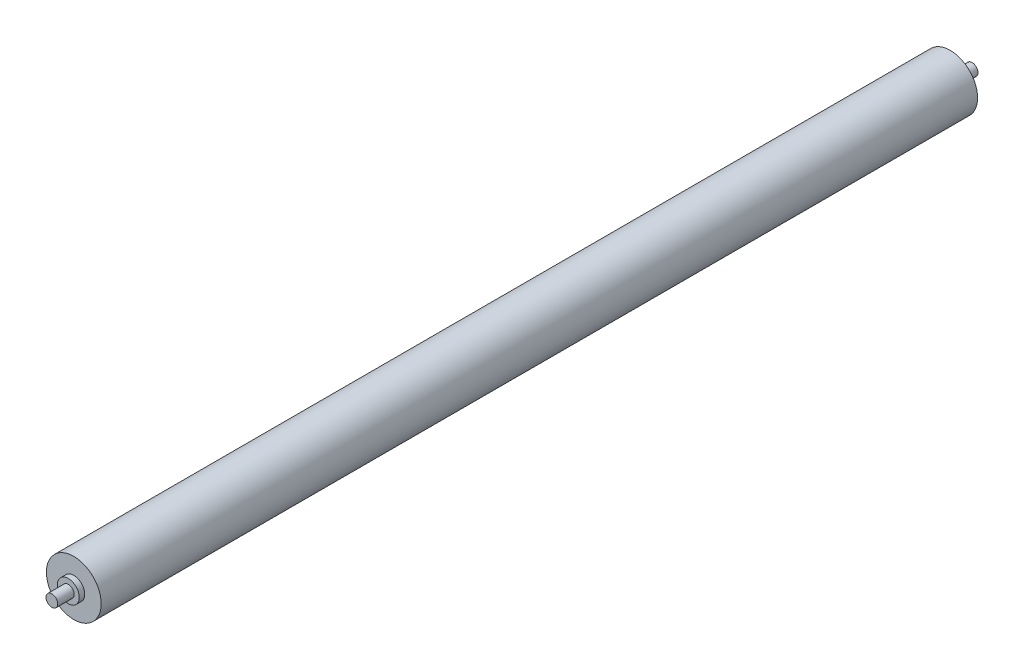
from build123d import *

# Parameters (mm, degrees)
SKIZZE1_R                       = 5.373076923
BASIS_LINEAR_AUSTRAGEN_DEPTH    = 15
SKIZZE2_R                       = 10
AUFSATZ_LINEAR_AUSTRAGEN1_DEPTH = 5
SKIZZE3_R                       = 25
AUFSATZ_LINEAR_AUSTRAGEN2_DEPTH = 800
SKIZZE5_R                       = 10
AUFSATZ_LINEAR_AUSTRAGEN4_DEPTH = 5
SKIZZE6_R                       = 5.373076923
AUFSATZ_LINEAR_AUSTRAGEN5_DEPTH = 15


with BuildPart() as part:
    # Skizze1 → Basis-Linear austragen (new body)
    with BuildSketch(Plane.XY):
        Circle(SKIZZE1_R)
    extrude(amount=BASIS_LINEAR_AUSTRAGEN_DEPTH)

    # Skizze2 → Aufsatz-Linear austragen1 (add)
    with BuildSketch(Plane.XY.offset(15)):
        Circle(SKIZZE2_R)
    extrude(amount=AUFSATZ_LINEAR_AUSTRAGEN1_DEPTH)

    # Skizze3 → Aufsatz-Linear austragen2 (add)
    with BuildSketch(Plane.XY.offset(20)):
        Circle(SKIZZE3_R)
    extrude(amount=AUFSATZ_LINEAR_AUSTRAGEN2_DEPTH)

    # Skizze5 → Aufsatz-Linear austragen4 (add)
    with BuildSketch(Plane.XY.offset(820)):
        Circle(SKIZZE5_R)
    extrude(amount=AUFSATZ_LINEAR_AUSTRAGEN4_DEPTH)

    # Skizze6 → Aufsatz-Linear austragen5 (add)
    with BuildSketch(Plane.XY.offset(825)):
        Circle(SKIZZE6_R)
    extrude(amount=AUFSATZ_LINEAR_AUSTRAGEN5_DEPTH)


solid = part.part
